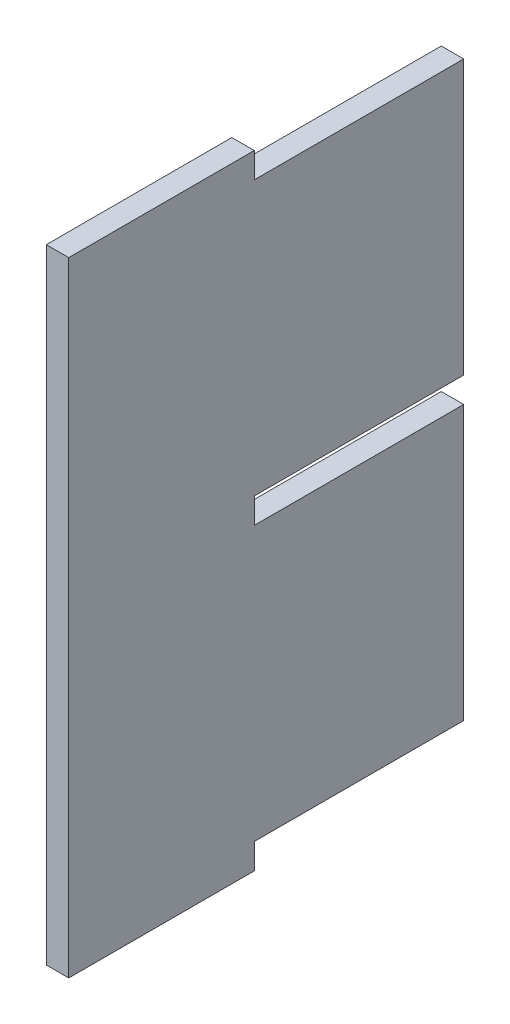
ISO-10303-21;
HEADER;
FILE_DESCRIPTION(('STEP AP214'),'2;1');
FILE_NAME('part.step','',(''),(''),'','','');
FILE_SCHEMA(('AUTOMOTIVE_DESIGN { 1 0 10303 214 1 1 1 1 }'));
ENDSEC;
DATA;
#1=APPLICATION_CONTEXT('core data for automotive mechanical design processes');
#2=APPLICATION_PROTOCOL_DEFINITION('international standard','automotive_design',2000,#1);
#3=PRODUCT_CONTEXT('',#1,'mechanical');
#4=PRODUCT('Part','Part','',(#3));
#5=PRODUCT_RELATED_PRODUCT_CATEGORY('part','',(#4));
#6=PRODUCT_DEFINITION_FORMATION('','',#4);
#7=PRODUCT_DEFINITION_CONTEXT('part definition',#1,'design');
#8=PRODUCT_DEFINITION('design','',#6,#7);
#9=PRODUCT_DEFINITION_SHAPE('','',#8);
#10=(LENGTH_UNIT() NAMED_UNIT(*) SI_UNIT(.MILLI.,.METRE.));
#11=(NAMED_UNIT(*) PLANE_ANGLE_UNIT() SI_UNIT($,.RADIAN.));
#12=(NAMED_UNIT(*) SI_UNIT($,.STERADIAN.) SOLID_ANGLE_UNIT());
#13=UNCERTAINTY_MEASURE_WITH_UNIT(LENGTH_MEASURE(1.E-05),#10,'distance_accuracy_value','');
#14=(GEOMETRIC_REPRESENTATION_CONTEXT(3) GLOBAL_UNCERTAINTY_ASSIGNED_CONTEXT((#13)) GLOBAL_UNIT_ASSIGNED_CONTEXT((#10,
#11,#12)) REPRESENTATION_CONTEXT('',''));
#15=CARTESIAN_POINT('',(0.,0.,0.));
#16=DIRECTION('',(0.,0.,1.));
#17=DIRECTION('',(1.,0.,0.));
#18=AXIS2_PLACEMENT_3D('',#15,#16,#17);
#19=CARTESIAN_POINT('',(0.,0.,0.));
#20=DIRECTION('',(0.,0.,-1.));
#21=DIRECTION('',(-1.,0.,0.));
#22=AXIS2_PLACEMENT_3D('',#19,#20,#21);
#23=PLANE('',#22);
#24=DIRECTION('',(1.,0.,0.));
#25=VECTOR('',#24,1.);
#26=CARTESIAN_POINT('',(-32.352836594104,19.15,0.));
#27=LINE('',#26,#25);
#28=CARTESIAN_POINT('',(-18.25,19.15,0.));
#29=VERTEX_POINT('',#28);
#30=CARTESIAN_POINT('',(-16.75,19.15,0.));
#31=VERTEX_POINT('',#30);
#32=EDGE_CURVE('E161',#29,#31,#27,.T.);
#33=ORIENTED_EDGE('',*,*,#32,.T.);
#34=DIRECTION('',(0.,1.,0.));
#35=VECTOR('',#34,1.);
#36=CARTESIAN_POINT('',(-16.75,-39.75,0.));
#37=LINE('',#36,#35);
#38=CARTESIAN_POINT('',(-16.75,0.849999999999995,0.));
#39=VERTEX_POINT('',#38);
#40=EDGE_CURVE('E37',#39,#31,#37,.T.);
#41=ORIENTED_EDGE('',*,*,#40,.F.);
#42=DIRECTION('',(1.,0.,0.));
#43=VECTOR('',#42,1.);
#44=CARTESIAN_POINT('',(-32.352836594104,0.849999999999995,0.));
#45=LINE('',#44,#43);
#46=CARTESIAN_POINT('',(-18.25,0.849999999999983,0.));
#47=VERTEX_POINT('',#46);
#48=EDGE_CURVE('E186',#47,#39,#45,.T.);
#49=ORIENTED_EDGE('',*,*,#48,.F.);
#50=DIRECTION('',(0.,-1.,0.));
#51=VECTOR('',#50,1.);
#52=CARTESIAN_POINT('',(-18.25,-39.75,0.));
#53=LINE('',#52,#51);
#54=EDGE_CURVE('E50',#29,#47,#53,.T.);
#55=ORIENTED_EDGE('',*,*,#54,.F.);
#56=EDGE_LOOP('',(#33,#41,#49,#55));
#57=FACE_BOUND('',#56,.T.);
#58=ADVANCED_FACE('F33',(#57),#23,.T.);
#59=DIRECTION('',(1.,0.,0.));
#60=VECTOR('',#59,1.);
#61=CARTESIAN_POINT('',(-32.352836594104,-0.850000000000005,0.));
#62=LINE('',#61,#60);
#63=CARTESIAN_POINT('',(-18.25,-0.850000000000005,0.));
#64=VERTEX_POINT('',#63);
#65=CARTESIAN_POINT('',(-16.75,-0.850000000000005,0.));
#66=VERTEX_POINT('',#65);
#67=EDGE_CURVE('E176',#64,#66,#62,.T.);
#68=ORIENTED_EDGE('',*,*,#67,.T.);
#69=CARTESIAN_POINT('',(-16.75,-19.15,0.));
#70=VERTEX_POINT('',#69);
#71=EDGE_CURVE('E211',#70,#66,#37,.T.);
#72=ORIENTED_EDGE('',*,*,#71,.F.);
#73=DIRECTION('',(1.,0.,0.));
#74=VECTOR('',#73,1.);
#75=CARTESIAN_POINT('',(-32.352836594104,-19.15,0.));
#76=LINE('',#75,#74);
#77=CARTESIAN_POINT('',(-18.25,-19.15,0.));
#78=VERTEX_POINT('',#77);
#79=EDGE_CURVE('E205',#78,#70,#76,.T.);
#80=ORIENTED_EDGE('',*,*,#79,.F.);
#81=EDGE_CURVE('E57',#64,#78,#53,.T.);
#82=ORIENTED_EDGE('',*,*,#81,.F.);
#83=EDGE_LOOP('',(#68,#72,#80,#82));
#84=FACE_BOUND('',#83,.T.);
#85=ADVANCED_FACE('F223',(#84),#23,.T.);
#86=CARTESIAN_POINT('',(-18.25,-39.75,26.4));
#87=DIRECTION('',(1.,0.,0.));
#88=DIRECTION('',(0.,0.,-1.));
#89=AXIS2_PLACEMENT_3D('',#86,#87,#88);
#90=PLANE('',#89);
#91=DIRECTION('',(0.,-1.,0.));
#92=VECTOR('',#91,1.);
#93=CARTESIAN_POINT('',(-18.25,-39.75,26.4));
#94=LINE('',#93,#92);
#95=CARTESIAN_POINT('',(-18.25,20.85,26.4));
#96=VERTEX_POINT('',#95);
#97=CARTESIAN_POINT('',(-18.25,-20.85,26.4));
#98=VERTEX_POINT('',#97);
#99=EDGE_CURVE('E42',#96,#98,#94,.T.);
#100=ORIENTED_EDGE('',*,*,#99,.F.);
#101=DIRECTION('',(0.,0.,1.));
#102=VECTOR('',#101,1.);
#103=CARTESIAN_POINT('',(-18.25,20.85,0.));
#104=LINE('',#103,#102);
#105=CARTESIAN_POINT('',(-18.25,20.85,14.));
#106=VERTEX_POINT('',#105);
#107=EDGE_CURVE('E132',#106,#96,#104,.T.);
#108=ORIENTED_EDGE('',*,*,#107,.F.);
#109=DIRECTION('',(0.,1.,0.));
#110=VECTOR('',#109,1.);
#111=CARTESIAN_POINT('',(-18.25,19.15,14.));
#112=LINE('',#111,#110);
#113=CARTESIAN_POINT('',(-18.25,19.15,14.));
#114=VERTEX_POINT('',#113);
#115=EDGE_CURVE('E157',#114,#106,#112,.T.);
#116=ORIENTED_EDGE('',*,*,#115,.F.);
#117=DIRECTION('',(0.,0.,1.));
#118=VECTOR('',#117,1.);
#119=CARTESIAN_POINT('',(-18.25,19.15,0.));
#120=LINE('',#119,#118);
#121=EDGE_CURVE('E160',#29,#114,#120,.T.);
#122=ORIENTED_EDGE('',*,*,#121,.F.);
#123=ORIENTED_EDGE('',*,*,#54,.T.);
#124=DIRECTION('',(0.,0.,-1.));
#125=VECTOR('',#124,1.);
#126=CARTESIAN_POINT('',(-18.25,0.849999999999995,0.));
#127=LINE('',#126,#125);
#128=CARTESIAN_POINT('',(-18.25,0.849999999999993,14.));
#129=VERTEX_POINT('',#128);
#130=EDGE_CURVE('E178',#129,#47,#127,.T.);
#131=ORIENTED_EDGE('',*,*,#130,.F.);
#132=DIRECTION('',(0.,1.,0.));
#133=VECTOR('',#132,1.);
#134=CARTESIAN_POINT('',(-18.25,-0.850000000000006,14.));
#135=LINE('',#134,#133);
#136=CARTESIAN_POINT('',(-18.25,-0.850000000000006,14.));
#137=VERTEX_POINT('',#136);
#138=EDGE_CURVE('E173',#137,#129,#135,.T.);
#139=ORIENTED_EDGE('',*,*,#138,.F.);
#140=DIRECTION('',(0.,0.,1.));
#141=VECTOR('',#140,1.);
#142=CARTESIAN_POINT('',(-18.25,-0.850000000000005,0.));
#143=LINE('',#142,#141);
#144=EDGE_CURVE('E175',#64,#137,#143,.T.);
#145=ORIENTED_EDGE('',*,*,#144,.F.);
#146=ORIENTED_EDGE('',*,*,#81,.T.);
#147=DIRECTION('',(0.,0.,-1.));
#148=VECTOR('',#147,1.);
#149=CARTESIAN_POINT('',(-18.25,-19.15,0.));
#150=LINE('',#149,#148);
#151=CARTESIAN_POINT('',(-18.25,-19.15,14.));
#152=VERTEX_POINT('',#151);
#153=EDGE_CURVE('E198',#152,#78,#150,.T.);
#154=ORIENTED_EDGE('',*,*,#153,.F.);
#155=DIRECTION('',(0.,1.,0.));
#156=VECTOR('',#155,1.);
#157=CARTESIAN_POINT('',(-18.25,-20.85,14.));
#158=LINE('',#157,#156);
#159=CARTESIAN_POINT('',(-18.25,-20.85,14.));
#160=VERTEX_POINT('',#159);
#161=EDGE_CURVE('E196',#160,#152,#158,.T.);
#162=ORIENTED_EDGE('',*,*,#161,.F.);
#163=DIRECTION('',(0.,0.,-1.));
#164=VECTOR('',#163,1.);
#165=CARTESIAN_POINT('',(-18.25,-20.85,0.));
#166=LINE('',#165,#164);
#167=EDGE_CURVE('E151',#98,#160,#166,.T.);
#168=ORIENTED_EDGE('',*,*,#167,.F.);
#169=EDGE_LOOP('',(#100,#108,#116,#122,#123,#131,#139,#145,#146,#154,#162,#168));
#170=FACE_BOUND('',#169,.T.);
#171=ADVANCED_FACE('F35',(#170),#90,.F.);
#172=CARTESIAN_POINT('',(-16.75,-39.75,26.4));
#173=DIRECTION('',(-1.,0.,0.));
#174=DIRECTION('',(0.,0.,1.));
#175=AXIS2_PLACEMENT_3D('',#172,#173,#174);
#176=PLANE('',#175);
#177=DIRECTION('',(0.,-1.,0.));
#178=VECTOR('',#177,1.);
#179=CARTESIAN_POINT('',(-16.75,19.15,14.));
#180=LINE('',#179,#178);
#181=CARTESIAN_POINT('',(-16.75,20.85,14.));
#182=VERTEX_POINT('',#181);
#183=CARTESIAN_POINT('',(-16.75,19.15,14.));
#184=VERTEX_POINT('',#183);
#185=EDGE_CURVE('E143',#182,#184,#180,.T.);
#186=ORIENTED_EDGE('',*,*,#185,.F.);
#187=DIRECTION('',(0.,0.,-1.));
#188=VECTOR('',#187,1.);
#189=CARTESIAN_POINT('',(-16.75,20.85,0.));
#190=LINE('',#189,#188);
#191=CARTESIAN_POINT('',(-16.75,20.85,26.4));
#192=VERTEX_POINT('',#191);
#193=EDGE_CURVE('E129',#192,#182,#190,.T.);
#194=ORIENTED_EDGE('',*,*,#193,.F.);
#195=DIRECTION('',(0.,1.,0.));
#196=VECTOR('',#195,1.);
#197=CARTESIAN_POINT('',(-16.75,-39.75,26.4));
#198=LINE('',#197,#196);
#199=CARTESIAN_POINT('',(-16.75,-20.85,26.4));
#200=VERTEX_POINT('',#199);
#201=EDGE_CURVE('E11',#200,#192,#198,.T.);
#202=ORIENTED_EDGE('',*,*,#201,.F.);
#203=DIRECTION('',(0.,0.,1.));
#204=VECTOR('',#203,1.);
#205=CARTESIAN_POINT('',(-16.75,-20.85,0.));
#206=LINE('',#205,#204);
#207=CARTESIAN_POINT('',(-16.75,-20.85,14.));
#208=VERTEX_POINT('',#207);
#209=EDGE_CURVE('E152',#208,#200,#206,.T.);
#210=ORIENTED_EDGE('',*,*,#209,.F.);
#211=DIRECTION('',(0.,-1.,0.));
#212=VECTOR('',#211,1.);
#213=CARTESIAN_POINT('',(-16.75,-20.85,14.));
#214=LINE('',#213,#212);
#215=CARTESIAN_POINT('',(-16.75,-19.15,14.));
#216=VERTEX_POINT('',#215);
#217=EDGE_CURVE('E202',#216,#208,#214,.T.);
#218=ORIENTED_EDGE('',*,*,#217,.F.);
#219=DIRECTION('',(0.,0.,1.));
#220=VECTOR('',#219,1.);
#221=CARTESIAN_POINT('',(-16.75,-19.15,0.));
#222=LINE('',#221,#220);
#223=EDGE_CURVE('E195',#70,#216,#222,.T.);
#224=ORIENTED_EDGE('',*,*,#223,.F.);
#225=ORIENTED_EDGE('',*,*,#71,.T.);
#226=DIRECTION('',(0.,0.,-1.));
#227=VECTOR('',#226,1.);
#228=CARTESIAN_POINT('',(-16.75,-0.850000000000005,0.));
#229=LINE('',#228,#227);
#230=CARTESIAN_POINT('',(-16.75,-0.850000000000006,14.));
#231=VERTEX_POINT('',#230);
#232=EDGE_CURVE('E184',#231,#66,#229,.T.);
#233=ORIENTED_EDGE('',*,*,#232,.F.);
#234=DIRECTION('',(0.,-1.,0.));
#235=VECTOR('',#234,1.);
#236=CARTESIAN_POINT('',(-16.75,-0.850000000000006,14.));
#237=LINE('',#236,#235);
#238=CARTESIAN_POINT('',(-16.75,0.849999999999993,14.));
#239=VERTEX_POINT('',#238);
#240=EDGE_CURVE('E181',#239,#231,#237,.T.);
#241=ORIENTED_EDGE('',*,*,#240,.F.);
#242=DIRECTION('',(0.,0.,1.));
#243=VECTOR('',#242,1.);
#244=CARTESIAN_POINT('',(-16.75,0.849999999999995,0.));
#245=LINE('',#244,#243);
#246=EDGE_CURVE('E163',#39,#239,#245,.T.);
#247=ORIENTED_EDGE('',*,*,#246,.F.);
#248=ORIENTED_EDGE('',*,*,#40,.T.);
#249=DIRECTION('',(0.,0.,-1.));
#250=VECTOR('',#249,1.);
#251=CARTESIAN_POINT('',(-16.75,19.15,0.));
#252=LINE('',#251,#250);
#253=EDGE_CURVE('E165',#184,#31,#252,.T.);
#254=ORIENTED_EDGE('',*,*,#253,.F.);
#255=EDGE_LOOP('',(#186,#194,#202,#210,#218,#224,#225,#233,#241,#247,#248,#254));
#256=FACE_BOUND('',#255,.T.);
#257=ADVANCED_FACE('F139',(#256),#176,.F.);
#258=CARTESIAN_POINT('',(0.,0.,26.4));
#259=DIRECTION('',(0.,0.,-1.));
#260=DIRECTION('',(-1.,0.,0.));
#261=AXIS2_PLACEMENT_3D('',#258,#259,#260);
#262=PLANE('',#261);
#263=ORIENTED_EDGE('',*,*,#201,.T.);
#264=DIRECTION('',(1.,0.,0.));
#265=VECTOR('',#264,1.);
#266=CARTESIAN_POINT('',(-50.7179842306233,20.85,26.4));
#267=LINE('',#266,#265);
#268=EDGE_CURVE('E126',#96,#192,#267,.T.);
#269=ORIENTED_EDGE('',*,*,#268,.F.);
#270=ORIENTED_EDGE('',*,*,#99,.T.);
#271=DIRECTION('',(1.,0.,0.));
#272=VECTOR('',#271,1.);
#273=CARTESIAN_POINT('',(-50.7179842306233,-20.85,26.4));
#274=LINE('',#273,#272);
#275=EDGE_CURVE('E148',#98,#200,#274,.T.);
#276=ORIENTED_EDGE('',*,*,#275,.T.);
#277=EDGE_LOOP('',(#263,#269,#270,#276));
#278=FACE_BOUND('',#277,.T.);
#279=ADVANCED_FACE('F146',(#278),#262,.F.);
#280=CARTESIAN_POINT('',(-32.352836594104,-20.85,14.));
#281=DIRECTION('',(0.,0.,1.));
#282=DIRECTION('',(1.,0.,0.));
#283=AXIS2_PLACEMENT_3D('',#280,#281,#282);
#284=PLANE('',#283);
#285=ORIENTED_EDGE('',*,*,#161,.T.);
#286=DIRECTION('',(1.,0.,0.));
#287=VECTOR('',#286,1.);
#288=CARTESIAN_POINT('',(-32.352836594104,-19.15,14.));
#289=LINE('',#288,#287);
#290=EDGE_CURVE('E207',#152,#216,#289,.T.);
#291=ORIENTED_EDGE('',*,*,#290,.T.);
#292=ORIENTED_EDGE('',*,*,#217,.T.);
#293=DIRECTION('',(1.,0.,0.));
#294=VECTOR('',#293,1.);
#295=CARTESIAN_POINT('',(-32.352836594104,-20.85,14.));
#296=LINE('',#295,#294);
#297=EDGE_CURVE('E199',#160,#208,#296,.T.);
#298=ORIENTED_EDGE('',*,*,#297,.F.);
#299=EDGE_LOOP('',(#285,#291,#292,#298));
#300=FACE_BOUND('',#299,.T.);
#301=ADVANCED_FACE('F263',(#300),#284,.F.);
#302=CARTESIAN_POINT('',(-32.352836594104,-19.15,0.));
#303=DIRECTION('',(0.,1.,0.));
#304=DIRECTION('',(0.,0.,1.));
#305=AXIS2_PLACEMENT_3D('',#302,#303,#304);
#306=PLANE('',#305);
#307=ORIENTED_EDGE('',*,*,#153,.T.);
#308=ORIENTED_EDGE('',*,*,#79,.T.);
#309=ORIENTED_EDGE('',*,*,#223,.T.);
#310=ORIENTED_EDGE('',*,*,#290,.F.);
#311=EDGE_LOOP('',(#307,#308,#309,#310));
#312=FACE_BOUND('',#311,.T.);
#313=ADVANCED_FACE('F279',(#312),#306,.F.);
#314=CARTESIAN_POINT('',(-32.352836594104,-0.850000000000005,0.));
#315=DIRECTION('',(0.,-1.,0.));
#316=DIRECTION('',(0.,0.,-1.));
#317=AXIS2_PLACEMENT_3D('',#314,#315,#316);
#318=PLANE('',#317);
#319=ORIENTED_EDGE('',*,*,#144,.T.);
#320=DIRECTION('',(1.,0.,0.));
#321=VECTOR('',#320,1.);
#322=CARTESIAN_POINT('',(-32.352836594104,-0.850000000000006,14.));
#323=LINE('',#322,#321);
#324=EDGE_CURVE('E189',#137,#231,#323,.T.);
#325=ORIENTED_EDGE('',*,*,#324,.T.);
#326=ORIENTED_EDGE('',*,*,#232,.T.);
#327=ORIENTED_EDGE('',*,*,#67,.F.);
#328=EDGE_LOOP('',(#319,#325,#326,#327));
#329=FACE_BOUND('',#328,.T.);
#330=ADVANCED_FACE('F225',(#329),#318,.F.);
#331=CARTESIAN_POINT('',(-32.352836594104,-0.850000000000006,14.));
#332=DIRECTION('',(0.,0.,1.));
#333=DIRECTION('',(1.,0.,0.));
#334=AXIS2_PLACEMENT_3D('',#331,#332,#333);
#335=PLANE('',#334);
#336=ORIENTED_EDGE('',*,*,#138,.T.);
#337=DIRECTION('',(1.,0.,0.));
#338=VECTOR('',#337,1.);
#339=CARTESIAN_POINT('',(-32.352836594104,0.849999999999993,14.));
#340=LINE('',#339,#338);
#341=EDGE_CURVE('E191',#129,#239,#340,.T.);
#342=ORIENTED_EDGE('',*,*,#341,.T.);
#343=ORIENTED_EDGE('',*,*,#240,.T.);
#344=ORIENTED_EDGE('',*,*,#324,.F.);
#345=EDGE_LOOP('',(#336,#342,#343,#344));
#346=FACE_BOUND('',#345,.T.);
#347=ADVANCED_FACE('F230',(#346),#335,.F.);
#348=CARTESIAN_POINT('',(-32.352836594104,0.849999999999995,0.));
#349=DIRECTION('',(0.,1.,0.));
#350=DIRECTION('',(0.,0.,1.));
#351=AXIS2_PLACEMENT_3D('',#348,#349,#350);
#352=PLANE('',#351);
#353=ORIENTED_EDGE('',*,*,#130,.T.);
#354=ORIENTED_EDGE('',*,*,#48,.T.);
#355=ORIENTED_EDGE('',*,*,#246,.T.);
#356=ORIENTED_EDGE('',*,*,#341,.F.);
#357=EDGE_LOOP('',(#353,#354,#355,#356));
#358=FACE_BOUND('',#357,.T.);
#359=ADVANCED_FACE('F232',(#358),#352,.F.);
#360=CARTESIAN_POINT('',(-32.352836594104,19.15,0.));
#361=DIRECTION('',(0.,-1.,0.));
#362=DIRECTION('',(0.,0.,-1.));
#363=AXIS2_PLACEMENT_3D('',#360,#361,#362);
#364=PLANE('',#363);
#365=ORIENTED_EDGE('',*,*,#121,.T.);
#366=DIRECTION('',(1.,0.,0.));
#367=VECTOR('',#366,1.);
#368=CARTESIAN_POINT('',(-32.352836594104,19.15,14.));
#369=LINE('',#368,#367);
#370=EDGE_CURVE('E170',#114,#184,#369,.T.);
#371=ORIENTED_EDGE('',*,*,#370,.T.);
#372=ORIENTED_EDGE('',*,*,#253,.T.);
#373=ORIENTED_EDGE('',*,*,#32,.F.);
#374=EDGE_LOOP('',(#365,#371,#372,#373));
#375=FACE_BOUND('',#374,.T.);
#376=ADVANCED_FACE('F236',(#375),#364,.F.);
#377=CARTESIAN_POINT('',(-32.352836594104,19.15,14.));
#378=DIRECTION('',(0.,0.,1.));
#379=DIRECTION('',(1.,0.,0.));
#380=AXIS2_PLACEMENT_3D('',#377,#378,#379);
#381=PLANE('',#380);
#382=ORIENTED_EDGE('',*,*,#115,.T.);
#383=DIRECTION('',(1.,0.,0.));
#384=VECTOR('',#383,1.);
#385=CARTESIAN_POINT('',(-32.352836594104,20.85,14.));
#386=LINE('',#385,#384);
#387=EDGE_CURVE('E167',#106,#182,#386,.T.);
#388=ORIENTED_EDGE('',*,*,#387,.T.);
#389=ORIENTED_EDGE('',*,*,#185,.T.);
#390=ORIENTED_EDGE('',*,*,#370,.F.);
#391=EDGE_LOOP('',(#382,#388,#389,#390));
#392=FACE_BOUND('',#391,.T.);
#393=ADVANCED_FACE('F240',(#392),#381,.F.);
#394=CARTESIAN_POINT('',(-50.7179842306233,-20.85,0.));
#395=DIRECTION('',(0.,1.,0.));
#396=DIRECTION('',(0.,0.,1.));
#397=AXIS2_PLACEMENT_3D('',#394,#395,#396);
#398=PLANE('',#397);
#399=ORIENTED_EDGE('',*,*,#209,.T.);
#400=ORIENTED_EDGE('',*,*,#275,.F.);
#401=ORIENTED_EDGE('',*,*,#167,.T.);
#402=ORIENTED_EDGE('',*,*,#297,.T.);
#403=EDGE_LOOP('',(#399,#400,#401,#402));
#404=FACE_BOUND('',#403,.T.);
#405=ADVANCED_FACE('F242',(#404),#398,.F.);
#406=CARTESIAN_POINT('',(-50.7179842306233,20.85,0.));
#407=DIRECTION('',(0.,-1.,0.));
#408=DIRECTION('',(0.,0.,-1.));
#409=AXIS2_PLACEMENT_3D('',#406,#407,#408);
#410=PLANE('',#409);
#411=ORIENTED_EDGE('',*,*,#107,.T.);
#412=ORIENTED_EDGE('',*,*,#268,.T.);
#413=ORIENTED_EDGE('',*,*,#193,.T.);
#414=ORIENTED_EDGE('',*,*,#387,.F.);
#415=EDGE_LOOP('',(#411,#412,#413,#414));
#416=FACE_BOUND('',#415,.T.);
#417=ADVANCED_FACE('F128',(#416),#410,.F.);
#418=CLOSED_SHELL('',(#58,#85,#171,#257,#279,#301,#313,#330,#347,#359,#376,#393,#405,#417));
#419=MANIFOLD_SOLID_BREP('B2',#418);
#420=ADVANCED_BREP_SHAPE_REPRESENTATION('',(#18,#419),#14);
#421=SHAPE_DEFINITION_REPRESENTATION(#9,#420);
ENDSEC;
END-ISO-10303-21;
